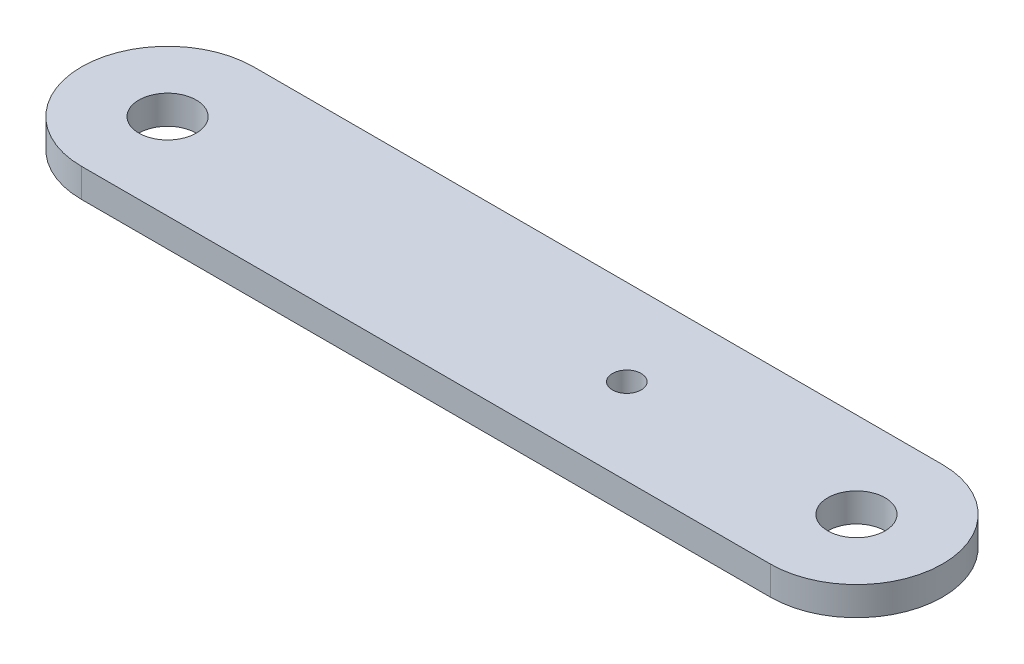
ISO-10303-21;
HEADER;
FILE_DESCRIPTION(('STEP AP214'),'2;1');
FILE_NAME('part.step','',(''),(''),'','','');
FILE_SCHEMA(('AUTOMOTIVE_DESIGN { 1 0 10303 214 1 1 1 1 }'));
ENDSEC;
DATA;
#1=APPLICATION_CONTEXT('core data for automotive mechanical design processes');
#2=APPLICATION_PROTOCOL_DEFINITION('international standard','automotive_design',2000,#1);
#3=PRODUCT_CONTEXT('',#1,'mechanical');
#4=PRODUCT('Part','Part','',(#3));
#5=PRODUCT_RELATED_PRODUCT_CATEGORY('part','',(#4));
#6=PRODUCT_DEFINITION_FORMATION('','',#4);
#7=PRODUCT_DEFINITION_CONTEXT('part definition',#1,'design');
#8=PRODUCT_DEFINITION('design','',#6,#7);
#9=PRODUCT_DEFINITION_SHAPE('','',#8);
#10=(LENGTH_UNIT() NAMED_UNIT(*) SI_UNIT(.MILLI.,.METRE.));
#11=(NAMED_UNIT(*) PLANE_ANGLE_UNIT() SI_UNIT($,.RADIAN.));
#12=(NAMED_UNIT(*) SI_UNIT($,.STERADIAN.) SOLID_ANGLE_UNIT());
#13=UNCERTAINTY_MEASURE_WITH_UNIT(LENGTH_MEASURE(1.E-05),#10,'distance_accuracy_value','');
#14=(GEOMETRIC_REPRESENTATION_CONTEXT(3) GLOBAL_UNCERTAINTY_ASSIGNED_CONTEXT((#13)) GLOBAL_UNIT_ASSIGNED_CONTEXT((#10,
#11,#12)) REPRESENTATION_CONTEXT('',''));
#15=CARTESIAN_POINT('',(0.,0.,0.));
#16=DIRECTION('',(0.,0.,1.));
#17=DIRECTION('',(1.,0.,0.));
#18=AXIS2_PLACEMENT_3D('',#15,#16,#17);
#19=CARTESIAN_POINT('',(76.2,3.175,0.));
#20=DIRECTION('',(0.,-1.,0.));
#21=DIRECTION('',(0.,0.,-1.));
#22=AXIS2_PLACEMENT_3D('',#19,#20,#21);
#23=CYLINDRICAL_SURFACE('',#22,19.05);
#24=CARTESIAN_POINT('',(76.2,-3.175,0.));
#25=DIRECTION('',(0.,1.,0.));
#26=DIRECTION('',(0.,0.,-1.));
#27=AXIS2_PLACEMENT_3D('',#24,#25,#26);
#28=CIRCLE('',#27,19.05);
#29=CARTESIAN_POINT('',(76.2,-3.175,19.05));
#30=VERTEX_POINT('',#29);
#31=CARTESIAN_POINT('',(76.2,-3.175,-19.05));
#32=VERTEX_POINT('',#31);
#33=EDGE_CURVE('E95',#30,#32,#28,.T.);
#34=ORIENTED_EDGE('',*,*,#33,.T.);
#35=DIRECTION('',(0.,-1.,0.));
#36=VECTOR('',#35,1.);
#37=CARTESIAN_POINT('',(76.2,3.175,-19.05));
#38=LINE('',#37,#36);
#39=CARTESIAN_POINT('',(76.2,3.175,-19.05));
#40=VERTEX_POINT('',#39);
#41=EDGE_CURVE('E11',#40,#32,#38,.T.);
#42=ORIENTED_EDGE('',*,*,#41,.F.);
#43=CARTESIAN_POINT('',(76.2,3.175,0.));
#44=DIRECTION('',(0.,1.,0.));
#45=DIRECTION('',(0.,0.,-1.));
#46=AXIS2_PLACEMENT_3D('',#43,#44,#45);
#47=CIRCLE('',#46,19.05);
#48=CARTESIAN_POINT('',(76.2,3.175,19.05));
#49=VERTEX_POINT('',#48);
#50=EDGE_CURVE('E83',#49,#40,#47,.T.);
#51=ORIENTED_EDGE('',*,*,#50,.F.);
#52=DIRECTION('',(0.,-1.,0.));
#53=VECTOR('',#52,1.);
#54=CARTESIAN_POINT('',(76.2,3.175,19.05));
#55=LINE('',#54,#53);
#56=EDGE_CURVE('E91',#49,#30,#55,.T.);
#57=ORIENTED_EDGE('',*,*,#56,.T.);
#58=EDGE_LOOP('',(#34,#42,#51,#57));
#59=FACE_BOUND('',#58,.T.);
#60=ADVANCED_FACE('F32',(#59),#23,.T.);
#61=CARTESIAN_POINT('',(-76.2,3.175,-19.05));
#62=DIRECTION('',(0.,0.,1.));
#63=DIRECTION('',(1.,0.,0.));
#64=AXIS2_PLACEMENT_3D('',#61,#62,#63);
#65=PLANE('',#64);
#66=DIRECTION('',(-1.,0.,0.));
#67=VECTOR('',#66,1.);
#68=CARTESIAN_POINT('',(-76.2,-3.175,-19.05));
#69=LINE('',#68,#67);
#70=CARTESIAN_POINT('',(-76.2,-3.175,-19.05));
#71=VERTEX_POINT('',#70);
#72=EDGE_CURVE('E87',#32,#71,#69,.T.);
#73=ORIENTED_EDGE('',*,*,#72,.T.);
#74=DIRECTION('',(0.,-1.,0.));
#75=VECTOR('',#74,1.);
#76=CARTESIAN_POINT('',(-76.2,3.175,-19.05));
#77=LINE('',#76,#75);
#78=CARTESIAN_POINT('',(-76.2,3.175,-19.05));
#79=VERTEX_POINT('',#78);
#80=EDGE_CURVE('E40',#79,#71,#77,.T.);
#81=ORIENTED_EDGE('',*,*,#80,.F.);
#82=DIRECTION('',(-1.,0.,0.));
#83=VECTOR('',#82,1.);
#84=CARTESIAN_POINT('',(-76.2,3.175,-19.05));
#85=LINE('',#84,#83);
#86=EDGE_CURVE('E78',#40,#79,#85,.T.);
#87=ORIENTED_EDGE('',*,*,#86,.F.);
#88=ORIENTED_EDGE('',*,*,#41,.T.);
#89=EDGE_LOOP('',(#73,#81,#87,#88));
#90=FACE_BOUND('',#89,.T.);
#91=ADVANCED_FACE('F86',(#90),#65,.F.);
#92=CARTESIAN_POINT('',(-76.2,3.175,0.));
#93=DIRECTION('',(0.,-1.,0.));
#94=DIRECTION('',(0.,0.,-1.));
#95=AXIS2_PLACEMENT_3D('',#92,#93,#94);
#96=CYLINDRICAL_SURFACE('',#95,19.05);
#97=CARTESIAN_POINT('',(-76.2,-3.175,0.));
#98=DIRECTION('',(0.,1.,0.));
#99=DIRECTION('',(0.,0.,1.));
#100=AXIS2_PLACEMENT_3D('',#97,#98,#99);
#101=CIRCLE('',#100,19.05);
#102=CARTESIAN_POINT('',(-76.2,-3.175,19.05));
#103=VERTEX_POINT('',#102);
#104=EDGE_CURVE('E65',#71,#103,#101,.T.);
#105=ORIENTED_EDGE('',*,*,#104,.T.);
#106=DIRECTION('',(0.,-1.,0.));
#107=VECTOR('',#106,1.);
#108=CARTESIAN_POINT('',(-76.2,3.175,19.05));
#109=LINE('',#108,#107);
#110=CARTESIAN_POINT('',(-76.2,3.175,19.05));
#111=VERTEX_POINT('',#110);
#112=EDGE_CURVE('E88',#111,#103,#109,.T.);
#113=ORIENTED_EDGE('',*,*,#112,.F.);
#114=CARTESIAN_POINT('',(-76.2,3.175,0.));
#115=DIRECTION('',(0.,1.,0.));
#116=DIRECTION('',(0.,0.,1.));
#117=AXIS2_PLACEMENT_3D('',#114,#115,#116);
#118=CIRCLE('',#117,19.05);
#119=EDGE_CURVE('E81',#79,#111,#118,.T.);
#120=ORIENTED_EDGE('',*,*,#119,.F.);
#121=ORIENTED_EDGE('',*,*,#80,.T.);
#122=EDGE_LOOP('',(#105,#113,#120,#121));
#123=FACE_BOUND('',#122,.T.);
#124=ADVANCED_FACE('F89',(#123),#96,.T.);
#125=CARTESIAN_POINT('',(-76.2,3.175,19.05));
#126=DIRECTION('',(0.,0.,-1.));
#127=DIRECTION('',(-1.,0.,0.));
#128=AXIS2_PLACEMENT_3D('',#125,#126,#127);
#129=PLANE('',#128);
#130=DIRECTION('',(1.,0.,0.));
#131=VECTOR('',#130,1.);
#132=CARTESIAN_POINT('',(-76.2,-3.175,19.05));
#133=LINE('',#132,#131);
#134=EDGE_CURVE('E71',#103,#30,#133,.T.);
#135=ORIENTED_EDGE('',*,*,#134,.T.);
#136=ORIENTED_EDGE('',*,*,#56,.F.);
#137=DIRECTION('',(1.,0.,0.));
#138=VECTOR('',#137,1.);
#139=CARTESIAN_POINT('',(-76.2,3.175,19.05));
#140=LINE('',#139,#138);
#141=EDGE_CURVE('E48',#111,#49,#140,.T.);
#142=ORIENTED_EDGE('',*,*,#141,.F.);
#143=ORIENTED_EDGE('',*,*,#112,.T.);
#144=EDGE_LOOP('',(#135,#136,#142,#143));
#145=FACE_BOUND('',#144,.T.);
#146=ADVANCED_FACE('F103',(#145),#129,.F.);
#147=CARTESIAN_POINT('',(76.2,3.175,0.));
#148=DIRECTION('',(0.,-1.,0.));
#149=DIRECTION('',(0.,0.,-1.));
#150=AXIS2_PLACEMENT_3D('',#147,#148,#149);
#151=PLANE('',#150);
#152=CARTESIAN_POINT('',(25.4,3.175,0.));
#153=DIRECTION('',(0.,1.,0.));
#154=DIRECTION('',(0.,0.,1.));
#155=AXIS2_PLACEMENT_3D('',#152,#153,#154);
#156=CIRCLE('',#155,3.175);
#157=CARTESIAN_POINT('',(25.4,3.175,3.175));
#158=VERTEX_POINT('',#157);
#159=EDGE_CURVE('E121',#158,#158,#156,.T.);
#160=ORIENTED_EDGE('',*,*,#159,.F.);
#161=EDGE_LOOP('',(#160));
#162=FACE_BOUND('',#161,.T.);
#163=CARTESIAN_POINT('',(76.2,3.175,0.));
#164=DIRECTION('',(0.,1.,0.));
#165=DIRECTION('',(0.,0.,1.));
#166=AXIS2_PLACEMENT_3D('',#163,#164,#165);
#167=CIRCLE('',#166,6.35);
#168=CARTESIAN_POINT('',(76.2,3.175,6.35));
#169=VERTEX_POINT('',#168);
#170=EDGE_CURVE('E115',#169,#169,#167,.T.);
#171=ORIENTED_EDGE('',*,*,#170,.F.);
#172=EDGE_LOOP('',(#171));
#173=FACE_BOUND('',#172,.T.);
#174=CARTESIAN_POINT('',(-76.2,3.175,0.));
#175=DIRECTION('',(0.,1.,0.));
#176=DIRECTION('',(0.,0.,1.));
#177=AXIS2_PLACEMENT_3D('',#174,#175,#176);
#178=CIRCLE('',#177,6.35);
#179=CARTESIAN_POINT('',(-76.2,3.175,6.35));
#180=VERTEX_POINT('',#179);
#181=EDGE_CURVE('E109',#180,#180,#178,.T.);
#182=ORIENTED_EDGE('',*,*,#181,.F.);
#183=EDGE_LOOP('',(#182));
#184=FACE_BOUND('',#183,.T.);
#185=ORIENTED_EDGE('',*,*,#50,.T.);
#186=ORIENTED_EDGE('',*,*,#86,.T.);
#187=ORIENTED_EDGE('',*,*,#119,.T.);
#188=ORIENTED_EDGE('',*,*,#141,.T.);
#189=EDGE_LOOP('',(#185,#186,#187,#188));
#190=FACE_BOUND('',#189,.T.);
#191=ADVANCED_FACE('F79',(#162,#173,#184,#190),#151,.F.);
#192=CARTESIAN_POINT('',(76.2,-3.175,0.));
#193=DIRECTION('',(0.,-1.,0.));
#194=DIRECTION('',(0.,0.,-1.));
#195=AXIS2_PLACEMENT_3D('',#192,#193,#194);
#196=PLANE('',#195);
#197=CARTESIAN_POINT('',(25.4,-3.175,0.));
#198=DIRECTION('',(0.,1.,0.));
#199=DIRECTION('',(0.,0.,1.));
#200=AXIS2_PLACEMENT_3D('',#197,#198,#199);
#201=CIRCLE('',#200,3.175);
#202=CARTESIAN_POINT('',(25.4,-3.175,3.175));
#203=VERTEX_POINT('',#202);
#204=EDGE_CURVE('E118',#203,#203,#201,.T.);
#205=ORIENTED_EDGE('',*,*,#204,.T.);
#206=EDGE_LOOP('',(#205));
#207=FACE_BOUND('',#206,.T.);
#208=CARTESIAN_POINT('',(76.2,-3.175,0.));
#209=DIRECTION('',(0.,1.,0.));
#210=DIRECTION('',(0.,0.,1.));
#211=AXIS2_PLACEMENT_3D('',#208,#209,#210);
#212=CIRCLE('',#211,6.35);
#213=CARTESIAN_POINT('',(76.2,-3.175,6.35));
#214=VERTEX_POINT('',#213);
#215=EDGE_CURVE('E112',#214,#214,#212,.T.);
#216=ORIENTED_EDGE('',*,*,#215,.T.);
#217=EDGE_LOOP('',(#216));
#218=FACE_BOUND('',#217,.T.);
#219=CARTESIAN_POINT('',(-76.2,-3.175,0.));
#220=DIRECTION('',(0.,1.,0.));
#221=DIRECTION('',(0.,0.,1.));
#222=AXIS2_PLACEMENT_3D('',#219,#220,#221);
#223=CIRCLE('',#222,6.35);
#224=CARTESIAN_POINT('',(-76.2,-3.175,6.35));
#225=VERTEX_POINT('',#224);
#226=EDGE_CURVE('E98',#225,#225,#223,.T.);
#227=ORIENTED_EDGE('',*,*,#226,.T.);
#228=EDGE_LOOP('',(#227));
#229=FACE_BOUND('',#228,.T.);
#230=ORIENTED_EDGE('',*,*,#33,.F.);
#231=ORIENTED_EDGE('',*,*,#134,.F.);
#232=ORIENTED_EDGE('',*,*,#104,.F.);
#233=ORIENTED_EDGE('',*,*,#72,.F.);
#234=EDGE_LOOP('',(#230,#231,#232,#233));
#235=FACE_BOUND('',#234,.T.);
#236=ADVANCED_FACE('F106',(#207,#218,#229,#235),#196,.T.);
#237=CARTESIAN_POINT('',(-76.2,-3.175,0.));
#238=DIRECTION('',(0.,1.,0.));
#239=DIRECTION('',(0.,0.,1.));
#240=AXIS2_PLACEMENT_3D('',#237,#238,#239);
#241=CYLINDRICAL_SURFACE('',#240,6.35);
#242=ORIENTED_EDGE('',*,*,#226,.F.);
#243=EDGE_LOOP('',(#242));
#244=FACE_BOUND('',#243,.T.);
#245=ORIENTED_EDGE('',*,*,#181,.T.);
#246=EDGE_LOOP('',(#245));
#247=FACE_BOUND('',#246,.T.);
#248=ADVANCED_FACE('F143',(#244,#247),#241,.F.);
#249=CARTESIAN_POINT('',(76.2,-3.175,0.));
#250=DIRECTION('',(0.,1.,0.));
#251=DIRECTION('',(0.,0.,1.));
#252=AXIS2_PLACEMENT_3D('',#249,#250,#251);
#253=CYLINDRICAL_SURFACE('',#252,6.35);
#254=ORIENTED_EDGE('',*,*,#215,.F.);
#255=EDGE_LOOP('',(#254));
#256=FACE_BOUND('',#255,.T.);
#257=ORIENTED_EDGE('',*,*,#170,.T.);
#258=EDGE_LOOP('',(#257));
#259=FACE_BOUND('',#258,.T.);
#260=ADVANCED_FACE('F132',(#256,#259),#253,.F.);
#261=CARTESIAN_POINT('',(25.4,-3.175,0.));
#262=DIRECTION('',(0.,1.,0.));
#263=DIRECTION('',(0.,0.,1.));
#264=AXIS2_PLACEMENT_3D('',#261,#262,#263);
#265=CYLINDRICAL_SURFACE('',#264,3.175);
#266=ORIENTED_EDGE('',*,*,#204,.F.);
#267=EDGE_LOOP('',(#266));
#268=FACE_BOUND('',#267,.T.);
#269=ORIENTED_EDGE('',*,*,#159,.T.);
#270=EDGE_LOOP('',(#269));
#271=FACE_BOUND('',#270,.T.);
#272=ADVANCED_FACE('F129',(#268,#271),#265,.F.);
#273=CLOSED_SHELL('',(#60,#91,#124,#146,#191,#236,#248,#260,#272));
#274=MANIFOLD_SOLID_BREP('B2',#273);
#275=ADVANCED_BREP_SHAPE_REPRESENTATION('',(#18,#274),#14);
#276=SHAPE_DEFINITION_REPRESENTATION(#9,#275);
ENDSEC;
END-ISO-10303-21;
